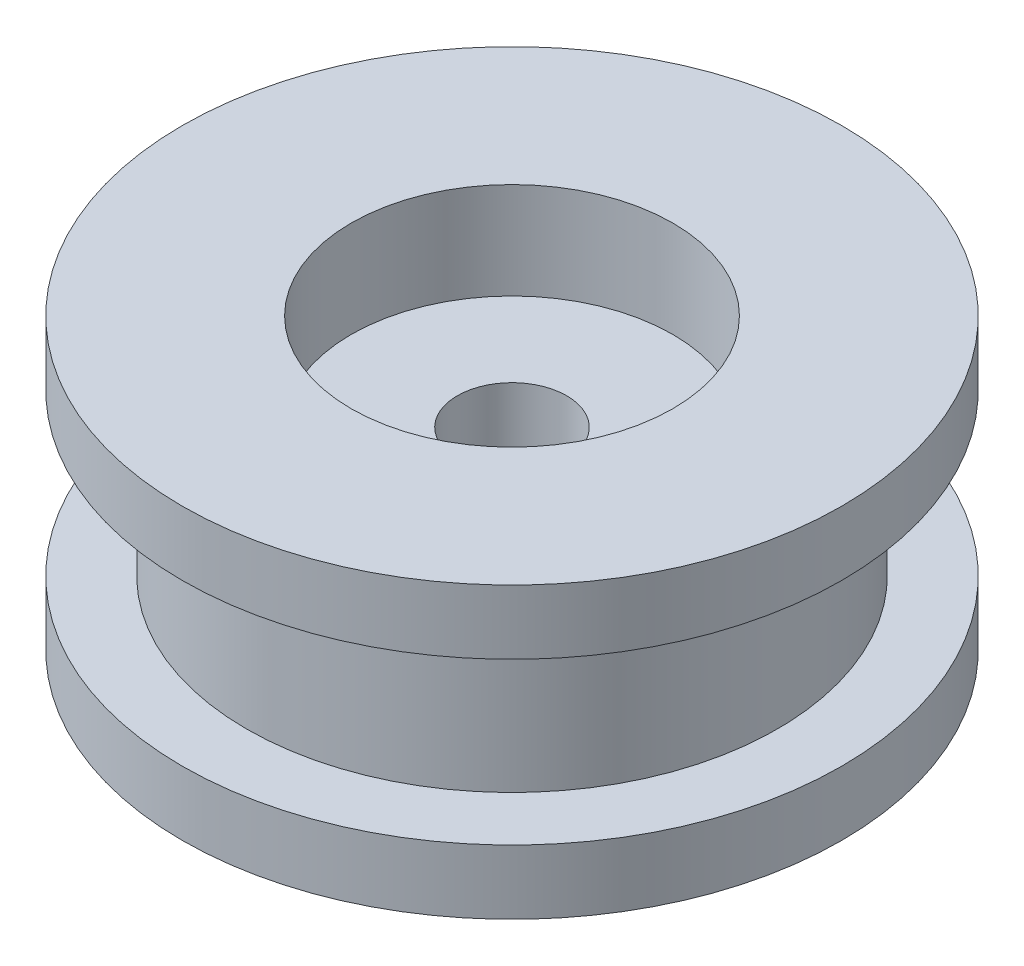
from build123d import *

# Parameters (mm, degrees)
TROU_TARAUD_M81_D = 6.8


with BuildPart() as part:
    # Esquisse1 → R_volution1 (revolve)
    with BuildSketch(Plane.XY, mode=Mode.PRIVATE) as r_volution1_sk:
        Polygon((-61.5, 50), (-61.5, 54), (-51, 54), (-51, 48), (-41, 48), (-41, 42), (-51, 42), (-51, 36), (-61.5, 36), (-61.5, 40), (-57.5, 40), (-57.5, 50), align=None)
    revolve(r_volution1_sk.sketch.rotate(Axis((-41, 42, 0), (0, 1, 0)), 270), axis=Axis((-41, 42, 0), (0, 1, 0)))

    # Trou taraud_ M81 (through all)
    with Locations(Plane(origin=(-41, 42, 0), x_dir=(0, 0, -1), z_dir=(0, -1, 0))):
        with Locations((0, 0)):
            Hole(TROU_TARAUD_M81_D / 2)


solid = part.part
